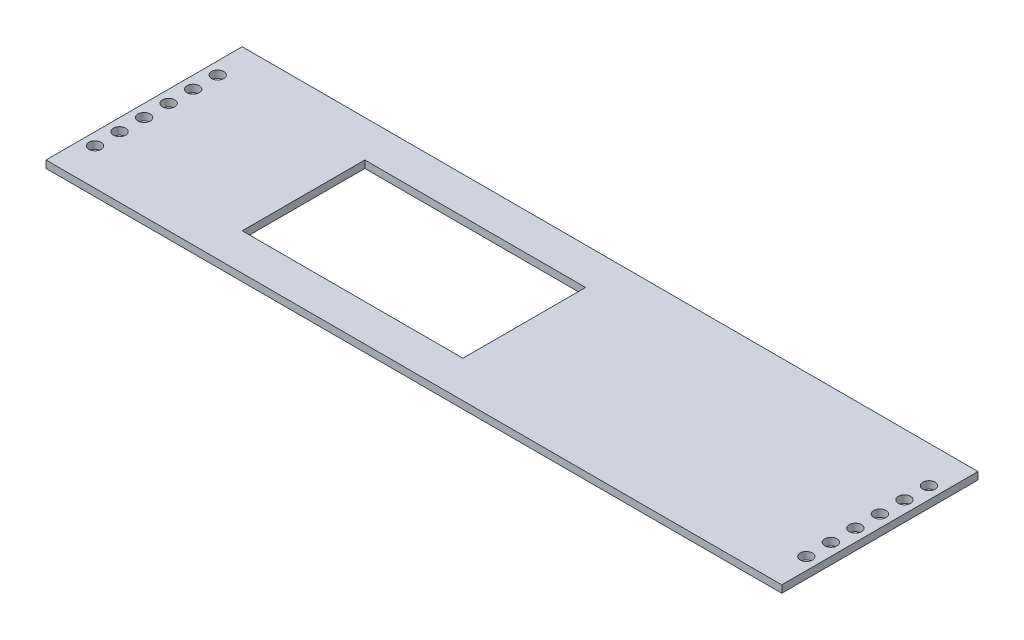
from build123d import *

# Parameters (mm, degrees)
SKETCH1_W           = 600
SKETCH1_H           = 160
BOSS_EXTRUDE1_DEPTH = 6
SKETCH2_R           = 5
CUT_EXTRUDE1_DEPTH  = 6
SKETCH5_W           = 180
SKETCH5_H           = 100
CUT_EXTRUDE2_DEPTH  = 10


with BuildPart() as part:
    # Sketch1 → Boss-Extrude1 (new body)
    with BuildSketch(Plane(origin=(0, 0, 0), x_dir=(1, 0, 0), z_dir=(0, 1, 0))):
        Rectangle(SKETCH1_W, SKETCH1_H)
    extrude(amount=BOSS_EXTRUDE1_DEPTH)

    # Sketch2 → Cut-Extrude1 (cut)
    with BuildSketch(Plane(origin=(0, 6, 0), x_dir=(1, 0, 0), z_dir=(0, 1, 0))):
        with Locations(Location((-290, -50, 0), (0, 0, 270))):
            Circle(SKETCH2_R)
        with Locations(Location((-290, -30, 0), (0, 0, 270))):
            Circle(SKETCH2_R)
        with Locations(Location((-290, -10, 0), (0, 0, 270))):
            Circle(SKETCH2_R)
        with Locations(Location((-290, 30, 0), (0, 0, 270))):
            Circle(SKETCH2_R)
        with Locations(Location((-290, 10, 0), (0, 0, 270))):
            Circle(SKETCH2_R)
        with Locations(Location((-290, 50, 0), (0, 0, 270))):
            Circle(SKETCH2_R)
    cut_extrude1 = extrude(amount=-CUT_EXTRUDE1_DEPTH, mode=Mode.SUBTRACT)

    # Mirror1: Cut-Extrude1 across plane
    add(cut_extrude1.mirror(Plane(origin=(0, 0, 0), x_dir=(0, 0, 1), z_dir=(1, 0, 0))), mode=Mode.SUBTRACT)

    # Sketch5 → Cut-Extrude2 (cut)
    with BuildSketch(Plane(origin=(0, 6, 0), x_dir=(1, 0, 0), z_dir=(0, 1, 0))):
        with Locations((-80, 0)):
            Rectangle(SKETCH5_W, SKETCH5_H)
    extrude(amount=-CUT_EXTRUDE2_DEPTH, mode=Mode.SUBTRACT)


solid = part.part
